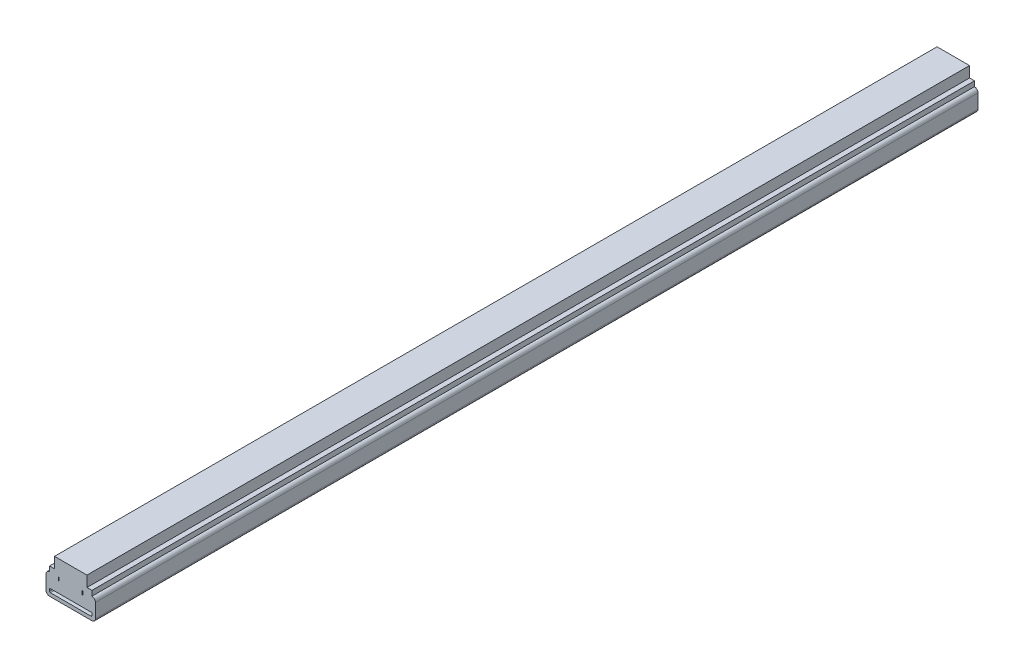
ISO-10303-21;
HEADER;
FILE_DESCRIPTION(('STEP AP214'),'2;1');
FILE_NAME('part.step','',(''),(''),'','','');
FILE_SCHEMA(('AUTOMOTIVE_DESIGN { 1 0 10303 214 1 1 1 1 }'));
ENDSEC;
DATA;
#1=APPLICATION_CONTEXT('core data for automotive mechanical design processes');
#2=APPLICATION_PROTOCOL_DEFINITION('international standard','automotive_design',2000,#1);
#3=PRODUCT_CONTEXT('',#1,'mechanical');
#4=PRODUCT('Part','Part','',(#3));
#5=PRODUCT_RELATED_PRODUCT_CATEGORY('part','',(#4));
#6=PRODUCT_DEFINITION_FORMATION('','',#4);
#7=PRODUCT_DEFINITION_CONTEXT('part definition',#1,'design');
#8=PRODUCT_DEFINITION('design','',#6,#7);
#9=PRODUCT_DEFINITION_SHAPE('','',#8);
#10=(LENGTH_UNIT() NAMED_UNIT(*) SI_UNIT(.MILLI.,.METRE.));
#11=(NAMED_UNIT(*) PLANE_ANGLE_UNIT() SI_UNIT($,.RADIAN.));
#12=(NAMED_UNIT(*) SI_UNIT($,.STERADIAN.) SOLID_ANGLE_UNIT());
#13=UNCERTAINTY_MEASURE_WITH_UNIT(LENGTH_MEASURE(1.E-05),#10,'distance_accuracy_value','');
#14=(GEOMETRIC_REPRESENTATION_CONTEXT(3) GLOBAL_UNCERTAINTY_ASSIGNED_CONTEXT((#13)) GLOBAL_UNIT_ASSIGNED_CONTEXT((#10,
#11,#12)) REPRESENTATION_CONTEXT('',''));
#15=CARTESIAN_POINT('',(0.,0.,0.));
#16=DIRECTION('',(0.,0.,1.));
#17=DIRECTION('',(1.,0.,0.));
#18=AXIS2_PLACEMENT_3D('',#15,#16,#17);
#19=CARTESIAN_POINT('',(9.2000000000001,21.,0.));
#20=DIRECTION('',(0.,1.,0.));
#21=DIRECTION('',(0.,0.,1.));
#22=AXIS2_PLACEMENT_3D('',#19,#20,#21);
#23=PLANE('',#22);
#24=DIRECTION('',(-1.,0.,0.));
#25=VECTOR('',#24,1.);
#26=CARTESIAN_POINT('',(9.2000000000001,21.,500.));
#27=LINE('',#26,#25);
#28=CARTESIAN_POINT('',(9.2000000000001,21.,500.));
#29=VERTEX_POINT('',#28);
#30=CARTESIAN_POINT('',(-9.2,21.,500.));
#31=VERTEX_POINT('',#30);
#32=EDGE_CURVE('E306',#29,#31,#27,.T.);
#33=ORIENTED_EDGE('',*,*,#32,.F.);
#34=DIRECTION('',(0.,0.,1.));
#35=VECTOR('',#34,1.);
#36=CARTESIAN_POINT('',(9.2000000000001,21.,0.));
#37=LINE('',#36,#35);
#38=CARTESIAN_POINT('',(9.2000000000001,21.,0.));
#39=VERTEX_POINT('',#38);
#40=EDGE_CURVE('E9',#39,#29,#37,.T.);
#41=ORIENTED_EDGE('',*,*,#40,.F.);
#42=DIRECTION('',(-1.,0.,0.));
#43=VECTOR('',#42,1.);
#44=CARTESIAN_POINT('',(9.2000000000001,21.,0.));
#45=LINE('',#44,#43);
#46=CARTESIAN_POINT('',(-9.2,21.,0.));
#47=VERTEX_POINT('',#46);
#48=EDGE_CURVE('E313',#39,#47,#45,.T.);
#49=ORIENTED_EDGE('',*,*,#48,.T.);
#50=DIRECTION('',(0.,0.,1.));
#51=VECTOR('',#50,1.);
#52=CARTESIAN_POINT('',(-9.2,21.,0.));
#53=LINE('',#52,#51);
#54=EDGE_CURVE('E17',#47,#31,#53,.T.);
#55=ORIENTED_EDGE('',*,*,#54,.T.);
#56=EDGE_LOOP('',(#33,#41,#49,#55));
#57=FACE_BOUND('',#56,.T.);
#58=ADVANCED_FACE('F14',(#57),#23,.T.);
#59=CARTESIAN_POINT('',(9.2000000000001,21.,0.));
#60=DIRECTION('',(-1.,0.,0.));
#61=DIRECTION('',(0.,-1.,0.));
#62=AXIS2_PLACEMENT_3D('',#59,#60,#61);
#63=PLANE('',#62);
#64=DIRECTION('',(0.,-1.,0.));
#65=VECTOR('',#64,1.);
#66=CARTESIAN_POINT('',(9.2000000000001,21.,500.));
#67=LINE('',#66,#65);
#68=CARTESIAN_POINT('',(9.20000000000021,14.9,500.));
#69=VERTEX_POINT('',#68);
#70=EDGE_CURVE('E317',#29,#69,#67,.T.);
#71=ORIENTED_EDGE('',*,*,#70,.T.);
#72=DIRECTION('',(0.,0.,1.));
#73=VECTOR('',#72,1.);
#74=CARTESIAN_POINT('',(9.20000000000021,14.9,0.));
#75=LINE('',#74,#73);
#76=CARTESIAN_POINT('',(9.20000000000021,14.9,0.));
#77=VERTEX_POINT('',#76);
#78=EDGE_CURVE('E22',#77,#69,#75,.T.);
#79=ORIENTED_EDGE('',*,*,#78,.F.);
#80=DIRECTION('',(0.,-1.,0.));
#81=VECTOR('',#80,1.);
#82=CARTESIAN_POINT('',(9.2000000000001,21.,0.));
#83=LINE('',#82,#81);
#84=EDGE_CURVE('E349',#39,#77,#83,.T.);
#85=ORIENTED_EDGE('',*,*,#84,.F.);
#86=ORIENTED_EDGE('',*,*,#40,.T.);
#87=EDGE_LOOP('',(#71,#79,#85,#86));
#88=FACE_BOUND('',#87,.T.);
#89=ADVANCED_FACE('F427',(#88),#63,.F.);
#90=CARTESIAN_POINT('',(9.20000000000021,14.9,0.));
#91=DIRECTION('',(0.,-1.,0.));
#92=DIRECTION('',(0.,0.,-1.));
#93=AXIS2_PLACEMENT_3D('',#90,#91,#92);
#94=PLANE('',#93);
#95=DIRECTION('',(1.,0.,0.));
#96=VECTOR('',#95,1.);
#97=CARTESIAN_POINT('',(9.20000000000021,14.9,500.));
#98=LINE('',#97,#96);
#99=CARTESIAN_POINT('',(12.0000057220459,14.9,500.));
#100=VERTEX_POINT('',#99);
#101=EDGE_CURVE('E386',#69,#100,#98,.T.);
#102=ORIENTED_EDGE('',*,*,#101,.T.);
#103=DIRECTION('',(0.,0.,1.));
#104=VECTOR('',#103,1.);
#105=CARTESIAN_POINT('',(12.0000057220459,14.9,0.));
#106=LINE('',#105,#104);
#107=CARTESIAN_POINT('',(12.0000057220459,14.9,0.));
#108=VERTEX_POINT('',#107);
#109=EDGE_CURVE('E391',#108,#100,#106,.T.);
#110=ORIENTED_EDGE('',*,*,#109,.F.);
#111=DIRECTION('',(1.,0.,0.));
#112=VECTOR('',#111,1.);
#113=CARTESIAN_POINT('',(9.20000000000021,14.9,0.));
#114=LINE('',#113,#112);
#115=EDGE_CURVE('E347',#77,#108,#114,.T.);
#116=ORIENTED_EDGE('',*,*,#115,.F.);
#117=ORIENTED_EDGE('',*,*,#78,.T.);
#118=EDGE_LOOP('',(#102,#110,#116,#117));
#119=FACE_BOUND('',#118,.T.);
#120=ADVANCED_FACE('F431',(#119),#94,.F.);
#121=CARTESIAN_POINT('',(12.0000057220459,14.9,0.));
#122=DIRECTION('',(-0.999999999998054,1.97311925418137E-06,0.));
#123=DIRECTION('',(-1.97311925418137E-06,-0.999999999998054,0.));
#124=AXIS2_PLACEMENT_3D('',#121,#122,#123);
#125=PLANE('',#124);
#126=DIRECTION('',(-1.97311925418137E-06,-0.999999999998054,0.));
#127=VECTOR('',#126,1.);
#128=CARTESIAN_POINT('',(12.0000057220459,14.9,500.));
#129=LINE('',#128,#127);
#130=CARTESIAN_POINT('',(12.,11.9999999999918,500.));
#131=VERTEX_POINT('',#130);
#132=EDGE_CURVE('E383',#100,#131,#129,.T.);
#133=ORIENTED_EDGE('',*,*,#132,.T.);
#134=DIRECTION('',(0.,0.,1.));
#135=VECTOR('',#134,1.);
#136=CARTESIAN_POINT('',(12.,11.9999999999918,0.));
#137=LINE('',#136,#135);
#138=CARTESIAN_POINT('',(12.,11.9999999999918,0.));
#139=VERTEX_POINT('',#138);
#140=EDGE_CURVE('E394',#139,#131,#137,.T.);
#141=ORIENTED_EDGE('',*,*,#140,.F.);
#142=DIRECTION('',(-1.97311925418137E-06,-0.999999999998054,0.));
#143=VECTOR('',#142,1.);
#144=CARTESIAN_POINT('',(12.0000057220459,14.9,0.));
#145=LINE('',#144,#143);
#146=EDGE_CURVE('E345',#108,#139,#145,.T.);
#147=ORIENTED_EDGE('',*,*,#146,.F.);
#148=ORIENTED_EDGE('',*,*,#109,.T.);
#149=EDGE_LOOP('',(#133,#141,#147,#148));
#150=FACE_BOUND('',#149,.T.);
#151=ADVANCED_FACE('F473',(#150),#125,.F.);
#152=CARTESIAN_POINT('',(12.000005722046,10.,0.));
#153=DIRECTION('',(0.,0.,1.));
#154=DIRECTION('',(1.,0.,0.));
#155=AXIS2_PLACEMENT_3D('',#152,#153,#154);
#156=CYLINDRICAL_SURFACE('',#155,2.);
#157=CARTESIAN_POINT('',(12.000005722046,10.,500.));
#158=DIRECTION('',(0.,0.,1.));
#159=DIRECTION('',(1.,0.,0.));
#160=AXIS2_PLACEMENT_3D('',#157,#158,#159);
#161=CIRCLE('',#160,2.);
#162=CARTESIAN_POINT('',(14.000005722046,10.,500.));
#163=VERTEX_POINT('',#162);
#164=EDGE_CURVE('E380',#163,#131,#161,.T.);
#165=ORIENTED_EDGE('',*,*,#164,.F.);
#166=DIRECTION('',(0.,0.,1.));
#167=VECTOR('',#166,1.);
#168=CARTESIAN_POINT('',(14.000005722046,10.,0.));
#169=LINE('',#168,#167);
#170=CARTESIAN_POINT('',(14.000005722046,10.,0.));
#171=VERTEX_POINT('',#170);
#172=EDGE_CURVE('E396',#171,#163,#169,.T.);
#173=ORIENTED_EDGE('',*,*,#172,.F.);
#174=CARTESIAN_POINT('',(12.000005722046,10.,0.));
#175=DIRECTION('',(0.,0.,1.));
#176=DIRECTION('',(1.,0.,0.));
#177=AXIS2_PLACEMENT_3D('',#174,#175,#176);
#178=CIRCLE('',#177,2.);
#179=EDGE_CURVE('E342',#171,#139,#178,.T.);
#180=ORIENTED_EDGE('',*,*,#179,.T.);
#181=ORIENTED_EDGE('',*,*,#140,.T.);
#182=EDGE_LOOP('',(#165,#173,#180,#181));
#183=FACE_BOUND('',#182,.T.);
#184=ADVANCED_FACE('F470',(#183),#156,.T.);
#185=CARTESIAN_POINT('',(14.000005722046,10.,0.));
#186=DIRECTION('',(-1.,0.,0.));
#187=DIRECTION('',(0.,0.,1.));
#188=AXIS2_PLACEMENT_3D('',#185,#186,#187);
#189=PLANE('',#188);
#190=DIRECTION('',(0.,-1.,0.));
#191=VECTOR('',#190,1.);
#192=CARTESIAN_POINT('',(14.000005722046,10.,500.));
#193=LINE('',#192,#191);
#194=CARTESIAN_POINT('',(14.000005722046,2.,500.));
#195=VERTEX_POINT('',#194);
#196=EDGE_CURVE('E377',#163,#195,#193,.T.);
#197=ORIENTED_EDGE('',*,*,#196,.T.);
#198=DIRECTION('',(0.,0.,1.));
#199=VECTOR('',#198,1.);
#200=CARTESIAN_POINT('',(14.000005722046,2.,0.));
#201=LINE('',#200,#199);
#202=CARTESIAN_POINT('',(14.000005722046,2.,0.));
#203=VERTEX_POINT('',#202);
#204=EDGE_CURVE('E398',#203,#195,#201,.T.);
#205=ORIENTED_EDGE('',*,*,#204,.F.);
#206=DIRECTION('',(0.,-1.,0.));
#207=VECTOR('',#206,1.);
#208=CARTESIAN_POINT('',(14.000005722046,10.,0.));
#209=LINE('',#208,#207);
#210=EDGE_CURVE('E340',#171,#203,#209,.T.);
#211=ORIENTED_EDGE('',*,*,#210,.F.);
#212=ORIENTED_EDGE('',*,*,#172,.T.);
#213=EDGE_LOOP('',(#197,#205,#211,#212));
#214=FACE_BOUND('',#213,.T.);
#215=ADVANCED_FACE('F482',(#214),#189,.F.);
#216=CARTESIAN_POINT('',(12.000005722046,2.,0.));
#217=DIRECTION('',(0.,0.,1.));
#218=DIRECTION('',(1.,0.,0.));
#219=AXIS2_PLACEMENT_3D('',#216,#217,#218);
#220=CYLINDRICAL_SURFACE('',#219,2.);
#221=CARTESIAN_POINT('',(12.000005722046,2.,500.));
#222=DIRECTION('',(0.,0.,1.));
#223=DIRECTION('',(1.,0.,0.));
#224=AXIS2_PLACEMENT_3D('',#221,#222,#223);
#225=CIRCLE('',#224,2.);
#226=CARTESIAN_POINT('',(12.000005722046,0.,500.));
#227=VERTEX_POINT('',#226);
#228=EDGE_CURVE('E374',#227,#195,#225,.T.);
#229=ORIENTED_EDGE('',*,*,#228,.F.);
#230=DIRECTION('',(0.,0.,1.));
#231=VECTOR('',#230,1.);
#232=CARTESIAN_POINT('',(12.000005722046,0.,0.));
#233=LINE('',#232,#231);
#234=CARTESIAN_POINT('',(12.000005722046,0.,0.));
#235=VERTEX_POINT('',#234);
#236=EDGE_CURVE('E400',#235,#227,#233,.T.);
#237=ORIENTED_EDGE('',*,*,#236,.F.);
#238=CARTESIAN_POINT('',(12.000005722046,2.,0.));
#239=DIRECTION('',(0.,0.,1.));
#240=DIRECTION('',(1.,0.,0.));
#241=AXIS2_PLACEMENT_3D('',#238,#239,#240);
#242=CIRCLE('',#241,2.);
#243=EDGE_CURVE('E337',#235,#203,#242,.T.);
#244=ORIENTED_EDGE('',*,*,#243,.T.);
#245=ORIENTED_EDGE('',*,*,#204,.T.);
#246=EDGE_LOOP('',(#229,#237,#244,#245));
#247=FACE_BOUND('',#246,.T.);
#248=ADVANCED_FACE('F464',(#247),#220,.T.);
#249=CARTESIAN_POINT('',(12.000005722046,0.,0.));
#250=DIRECTION('',(0.,1.,0.));
#251=DIRECTION('',(-1.,0.,0.));
#252=AXIS2_PLACEMENT_3D('',#249,#250,#251);
#253=PLANE('',#252);
#254=DIRECTION('',(-1.,0.,0.));
#255=VECTOR('',#254,1.);
#256=CARTESIAN_POINT('',(12.000005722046,0.,500.));
#257=LINE('',#256,#255);
#258=CARTESIAN_POINT('',(-12.000005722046,0.,500.));
#259=VERTEX_POINT('',#258);
#260=EDGE_CURVE('E371',#227,#259,#257,.T.);
#261=ORIENTED_EDGE('',*,*,#260,.T.);
#262=DIRECTION('',(0.,0.,1.));
#263=VECTOR('',#262,1.);
#264=CARTESIAN_POINT('',(-12.000005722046,0.,0.));
#265=LINE('',#264,#263);
#266=CARTESIAN_POINT('',(-12.000005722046,0.,0.));
#267=VERTEX_POINT('',#266);
#268=EDGE_CURVE('E402',#267,#259,#265,.T.);
#269=ORIENTED_EDGE('',*,*,#268,.F.);
#270=DIRECTION('',(-1.,0.,0.));
#271=VECTOR('',#270,1.);
#272=CARTESIAN_POINT('',(12.000005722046,0.,0.));
#273=LINE('',#272,#271);
#274=EDGE_CURVE('E335',#235,#267,#273,.T.);
#275=ORIENTED_EDGE('',*,*,#274,.F.);
#276=ORIENTED_EDGE('',*,*,#236,.T.);
#277=EDGE_LOOP('',(#261,#269,#275,#276));
#278=FACE_BOUND('',#277,.T.);
#279=ADVANCED_FACE('F461',(#278),#253,.F.);
#280=CARTESIAN_POINT('',(-12.000005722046,2.,0.));
#281=DIRECTION('',(0.,0.,1.));
#282=DIRECTION('',(1.,0.,0.));
#283=AXIS2_PLACEMENT_3D('',#280,#281,#282);
#284=CYLINDRICAL_SURFACE('',#283,2.);
#285=CARTESIAN_POINT('',(-12.000005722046,2.,500.));
#286=DIRECTION('',(0.,0.,1.));
#287=DIRECTION('',(1.,0.,0.));
#288=AXIS2_PLACEMENT_3D('',#285,#286,#287);
#289=CIRCLE('',#288,2.);
#290=CARTESIAN_POINT('',(-14.000005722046,2.,500.));
#291=VERTEX_POINT('',#290);
#292=EDGE_CURVE('E368',#291,#259,#289,.T.);
#293=ORIENTED_EDGE('',*,*,#292,.F.);
#294=DIRECTION('',(0.,0.,1.));
#295=VECTOR('',#294,1.);
#296=CARTESIAN_POINT('',(-14.000005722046,2.,0.));
#297=LINE('',#296,#295);
#298=CARTESIAN_POINT('',(-14.000005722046,2.,0.));
#299=VERTEX_POINT('',#298);
#300=EDGE_CURVE('E404',#299,#291,#297,.T.);
#301=ORIENTED_EDGE('',*,*,#300,.F.);
#302=CARTESIAN_POINT('',(-12.000005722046,2.,0.));
#303=DIRECTION('',(0.,0.,1.));
#304=DIRECTION('',(1.,0.,0.));
#305=AXIS2_PLACEMENT_3D('',#302,#303,#304);
#306=CIRCLE('',#305,2.);
#307=EDGE_CURVE('E332',#299,#267,#306,.T.);
#308=ORIENTED_EDGE('',*,*,#307,.T.);
#309=ORIENTED_EDGE('',*,*,#268,.T.);
#310=EDGE_LOOP('',(#293,#301,#308,#309));
#311=FACE_BOUND('',#310,.T.);
#312=ADVANCED_FACE('F456',(#311),#284,.T.);
#313=CARTESIAN_POINT('',(-14.0000057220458,10.,0.));
#314=DIRECTION('',(-1.,0.,0.));
#315=DIRECTION('',(0.,-1.,0.));
#316=AXIS2_PLACEMENT_3D('',#313,#314,#315);
#317=PLANE('',#316);
#318=DIRECTION('',(0.,-1.,0.));
#319=VECTOR('',#318,1.);
#320=CARTESIAN_POINT('',(-14.0000057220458,10.,500.));
#321=LINE('',#320,#319);
#322=CARTESIAN_POINT('',(-14.0000057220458,10.,500.));
#323=VERTEX_POINT('',#322);
#324=EDGE_CURVE('E365',#323,#291,#321,.T.);
#325=ORIENTED_EDGE('',*,*,#324,.F.);
#326=DIRECTION('',(0.,0.,1.));
#327=VECTOR('',#326,1.);
#328=CARTESIAN_POINT('',(-14.0000057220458,10.,0.));
#329=LINE('',#328,#327);
#330=CARTESIAN_POINT('',(-14.0000057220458,10.,0.));
#331=VERTEX_POINT('',#330);
#332=EDGE_CURVE('E406',#331,#323,#329,.T.);
#333=ORIENTED_EDGE('',*,*,#332,.F.);
#334=DIRECTION('',(0.,-1.,0.));
#335=VECTOR('',#334,1.);
#336=CARTESIAN_POINT('',(-14.0000057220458,10.,0.));
#337=LINE('',#336,#335);
#338=EDGE_CURVE('E329',#331,#299,#337,.T.);
#339=ORIENTED_EDGE('',*,*,#338,.T.);
#340=ORIENTED_EDGE('',*,*,#300,.T.);
#341=EDGE_LOOP('',(#325,#333,#339,#340));
#342=FACE_BOUND('',#341,.T.);
#343=ADVANCED_FACE('F451',(#342),#317,.T.);
#344=CARTESIAN_POINT('',(-12.0000057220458,10.,0.));
#345=DIRECTION('',(0.,0.,1.));
#346=DIRECTION('',(1.,0.,0.));
#347=AXIS2_PLACEMENT_3D('',#344,#345,#346);
#348=CYLINDRICAL_SURFACE('',#347,2.);
#349=CARTESIAN_POINT('',(-12.0000057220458,10.,500.));
#350=DIRECTION('',(0.,0.,1.));
#351=DIRECTION('',(1.,0.,0.));
#352=AXIS2_PLACEMENT_3D('',#349,#350,#351);
#353=CIRCLE('',#352,2.);
#354=CARTESIAN_POINT('',(-12.0000057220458,12.,500.));
#355=VERTEX_POINT('',#354);
#356=EDGE_CURVE('E362',#355,#323,#353,.T.);
#357=ORIENTED_EDGE('',*,*,#356,.F.);
#358=DIRECTION('',(0.,0.,1.));
#359=VECTOR('',#358,1.);
#360=CARTESIAN_POINT('',(-12.0000057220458,12.,0.));
#361=LINE('',#360,#359);
#362=CARTESIAN_POINT('',(-12.0000057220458,12.,0.));
#363=VERTEX_POINT('',#362);
#364=EDGE_CURVE('E408',#363,#355,#361,.T.);
#365=ORIENTED_EDGE('',*,*,#364,.F.);
#366=CARTESIAN_POINT('',(-12.0000057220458,10.,0.));
#367=DIRECTION('',(0.,0.,1.));
#368=DIRECTION('',(1.,0.,0.));
#369=AXIS2_PLACEMENT_3D('',#366,#367,#368);
#370=CIRCLE('',#369,2.);
#371=EDGE_CURVE('E326',#363,#331,#370,.T.);
#372=ORIENTED_EDGE('',*,*,#371,.T.);
#373=ORIENTED_EDGE('',*,*,#332,.T.);
#374=EDGE_LOOP('',(#357,#365,#372,#373));
#375=FACE_BOUND('',#374,.T.);
#376=ADVANCED_FACE('F447',(#375),#348,.T.);
#377=CARTESIAN_POINT('',(-12.,14.9,0.));
#378=DIRECTION('',(-0.999999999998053,1.97311927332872E-06,0.));
#379=DIRECTION('',(-1.97311927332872E-06,-0.999999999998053,0.));
#380=AXIS2_PLACEMENT_3D('',#377,#378,#379);
#381=PLANE('',#380);
#382=DIRECTION('',(-1.97311927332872E-06,-0.999999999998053,0.));
#383=VECTOR('',#382,1.);
#384=CARTESIAN_POINT('',(-12.,14.9,500.));
#385=LINE('',#384,#383);
#386=CARTESIAN_POINT('',(-12.,14.9,500.));
#387=VERTEX_POINT('',#386);
#388=EDGE_CURVE('E359',#387,#355,#385,.T.);
#389=ORIENTED_EDGE('',*,*,#388,.F.);
#390=DIRECTION('',(0.,0.,1.));
#391=VECTOR('',#390,1.);
#392=CARTESIAN_POINT('',(-12.,14.9,0.));
#393=LINE('',#392,#391);
#394=CARTESIAN_POINT('',(-12.,14.9,0.));
#395=VERTEX_POINT('',#394);
#396=EDGE_CURVE('E410',#395,#387,#393,.T.);
#397=ORIENTED_EDGE('',*,*,#396,.F.);
#398=DIRECTION('',(-1.97311927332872E-06,-0.999999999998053,0.));
#399=VECTOR('',#398,1.);
#400=CARTESIAN_POINT('',(-12.,14.9,0.));
#401=LINE('',#400,#399);
#402=EDGE_CURVE('E323',#395,#363,#401,.T.);
#403=ORIENTED_EDGE('',*,*,#402,.T.);
#404=ORIENTED_EDGE('',*,*,#364,.T.);
#405=EDGE_LOOP('',(#389,#397,#403,#404));
#406=FACE_BOUND('',#405,.T.);
#407=ADVANCED_FACE('F445',(#406),#381,.T.);
#408=CARTESIAN_POINT('',(-9.2,14.9,0.));
#409=DIRECTION('',(0.,1.,0.));
#410=DIRECTION('',(0.,0.,1.));
#411=AXIS2_PLACEMENT_3D('',#408,#409,#410);
#412=PLANE('',#411);
#413=DIRECTION('',(-1.,0.,0.));
#414=VECTOR('',#413,1.);
#415=CARTESIAN_POINT('',(-9.2,14.9,500.));
#416=LINE('',#415,#414);
#417=CARTESIAN_POINT('',(-9.2,14.9,500.));
#418=VERTEX_POINT('',#417);
#419=EDGE_CURVE('E356',#418,#387,#416,.T.);
#420=ORIENTED_EDGE('',*,*,#419,.F.);
#421=DIRECTION('',(0.,0.,1.));
#422=VECTOR('',#421,1.);
#423=CARTESIAN_POINT('',(-9.2,14.9,0.));
#424=LINE('',#423,#422);
#425=CARTESIAN_POINT('',(-9.2,14.9,0.));
#426=VERTEX_POINT('',#425);
#427=EDGE_CURVE('E411',#426,#418,#424,.T.);
#428=ORIENTED_EDGE('',*,*,#427,.F.);
#429=DIRECTION('',(-1.,0.,0.));
#430=VECTOR('',#429,1.);
#431=CARTESIAN_POINT('',(-9.2,14.9,0.));
#432=LINE('',#431,#430);
#433=EDGE_CURVE('E320',#426,#395,#432,.T.);
#434=ORIENTED_EDGE('',*,*,#433,.T.);
#435=ORIENTED_EDGE('',*,*,#396,.T.);
#436=EDGE_LOOP('',(#420,#428,#434,#435));
#437=FACE_BOUND('',#436,.T.);
#438=ADVANCED_FACE('F441',(#437),#412,.T.);
#439=CARTESIAN_POINT('',(-9.2,21.,0.));
#440=DIRECTION('',(-1.,0.,0.));
#441=DIRECTION('',(0.,0.,1.));
#442=AXIS2_PLACEMENT_3D('',#439,#440,#441);
#443=PLANE('',#442);
#444=DIRECTION('',(0.,-1.,0.));
#445=VECTOR('',#444,1.);
#446=CARTESIAN_POINT('',(-9.2,21.,500.));
#447=LINE('',#446,#445);
#448=EDGE_CURVE('E353',#31,#418,#447,.T.);
#449=ORIENTED_EDGE('',*,*,#448,.F.);
#450=ORIENTED_EDGE('',*,*,#54,.F.);
#451=DIRECTION('',(0.,-1.,0.));
#452=VECTOR('',#451,1.);
#453=CARTESIAN_POINT('',(-9.2,21.,0.));
#454=LINE('',#453,#452);
#455=EDGE_CURVE('E316',#47,#426,#454,.T.);
#456=ORIENTED_EDGE('',*,*,#455,.T.);
#457=ORIENTED_EDGE('',*,*,#427,.T.);
#458=EDGE_LOOP('',(#449,#450,#456,#457));
#459=FACE_BOUND('',#458,.T.);
#460=ADVANCED_FACE('F419',(#459),#443,.T.);
#461=CARTESIAN_POINT('',(-12.0000057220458,10.,0.));
#462=DIRECTION('',(0.,0.,1.));
#463=DIRECTION('',(1.,0.,0.));
#464=AXIS2_PLACEMENT_3D('',#461,#462,#463);
#465=PLANE('',#464);
#466=DIRECTION('',(-1.,0.,0.));
#467=VECTOR('',#466,1.);
#468=CARTESIAN_POINT('',(11.5,2.,0.));
#469=LINE('',#468,#467);
#470=CARTESIAN_POINT('',(11.5,2.,0.));
#471=VERTEX_POINT('',#470);
#472=CARTESIAN_POINT('',(-11.5,2.,0.));
#473=VERTEX_POINT('',#472);
#474=EDGE_CURVE('E212',#471,#473,#469,.T.);
#475=ORIENTED_EDGE('',*,*,#474,.F.);
#476=CARTESIAN_POINT('',(11.5,2.5,0.));
#477=DIRECTION('',(0.,0.,1.));
#478=DIRECTION('',(1.,0.,0.));
#479=AXIS2_PLACEMENT_3D('',#476,#477,#478);
#480=CIRCLE('',#479,0.5);
#481=CARTESIAN_POINT('',(12.,2.5,0.));
#482=VERTEX_POINT('',#481);
#483=EDGE_CURVE('E207',#471,#482,#480,.T.);
#484=ORIENTED_EDGE('',*,*,#483,.T.);
#485=DIRECTION('',(0.,-1.,0.));
#486=VECTOR('',#485,1.);
#487=CARTESIAN_POINT('',(12.,4.00000000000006,0.));
#488=LINE('',#487,#486);
#489=CARTESIAN_POINT('',(12.,4.00000000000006,0.));
#490=VERTEX_POINT('',#489);
#491=EDGE_CURVE('E199',#490,#482,#488,.T.);
#492=ORIENTED_EDGE('',*,*,#491,.F.);
#493=DIRECTION('',(-1.,0.,0.));
#494=VECTOR('',#493,1.);
#495=CARTESIAN_POINT('',(12.,4.00000000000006,0.));
#496=LINE('',#495,#494);
#497=CARTESIAN_POINT('',(-12.,4.00000000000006,0.));
#498=VERTEX_POINT('',#497);
#499=EDGE_CURVE('E30',#490,#498,#496,.T.);
#500=ORIENTED_EDGE('',*,*,#499,.T.);
#501=DIRECTION('',(0.,-1.,0.));
#502=VECTOR('',#501,1.);
#503=CARTESIAN_POINT('',(-12.,4.00000000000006,0.));
#504=LINE('',#503,#502);
#505=CARTESIAN_POINT('',(-12.,2.5,0.));
#506=VERTEX_POINT('',#505);
#507=EDGE_CURVE('E224',#498,#506,#504,.T.);
#508=ORIENTED_EDGE('',*,*,#507,.T.);
#509=CARTESIAN_POINT('',(-11.5,2.5,0.));
#510=DIRECTION('',(0.,0.,1.));
#511=DIRECTION('',(1.,0.,0.));
#512=AXIS2_PLACEMENT_3D('',#509,#510,#511);
#513=CIRCLE('',#512,0.5);
#514=EDGE_CURVE('E227',#506,#473,#513,.T.);
#515=ORIENTED_EDGE('',*,*,#514,.T.);
#516=EDGE_LOOP('',(#475,#484,#492,#500,#508,#515));
#517=FACE_BOUND('',#516,.T.);
#518=DIRECTION('',(0.,-1.,0.));
#519=VECTOR('',#518,1.);
#520=CARTESIAN_POINT('',(7.,12.,0.));
#521=LINE('',#520,#519);
#522=CARTESIAN_POINT('',(7.,12.,0.));
#523=VERTEX_POINT('',#522);
#524=CARTESIAN_POINT('',(7.,10.,0.));
#525=VERTEX_POINT('',#524);
#526=EDGE_CURVE('E261',#523,#525,#521,.T.);
#527=ORIENTED_EDGE('',*,*,#526,.F.);
#528=DIRECTION('',(-1.,0.,0.));
#529=VECTOR('',#528,1.);
#530=CARTESIAN_POINT('',(7.,12.,0.));
#531=LINE('',#530,#529);
#532=CARTESIAN_POINT('',(6.5,12.,0.));
#533=VERTEX_POINT('',#532);
#534=EDGE_CURVE('E251',#523,#533,#531,.T.);
#535=ORIENTED_EDGE('',*,*,#534,.T.);
#536=DIRECTION('',(0.,-1.,0.));
#537=VECTOR('',#536,1.);
#538=CARTESIAN_POINT('',(6.5,12.,0.));
#539=LINE('',#538,#537);
#540=CARTESIAN_POINT('',(6.5,10.,0.));
#541=VERTEX_POINT('',#540);
#542=EDGE_CURVE('E254',#533,#541,#539,.T.);
#543=ORIENTED_EDGE('',*,*,#542,.T.);
#544=DIRECTION('',(1.,0.,0.));
#545=VECTOR('',#544,1.);
#546=CARTESIAN_POINT('',(6.5,10.,0.));
#547=LINE('',#546,#545);
#548=EDGE_CURVE('E258',#541,#525,#547,.T.);
#549=ORIENTED_EDGE('',*,*,#548,.T.);
#550=EDGE_LOOP('',(#527,#535,#543,#549));
#551=FACE_BOUND('',#550,.T.);
#552=DIRECTION('',(0.,-1.,0.));
#553=VECTOR('',#552,1.);
#554=CARTESIAN_POINT('',(-6.5,12.,0.));
#555=LINE('',#554,#553);
#556=CARTESIAN_POINT('',(-6.5,12.,0.));
#557=VERTEX_POINT('',#556);
#558=CARTESIAN_POINT('',(-6.5,10.,0.));
#559=VERTEX_POINT('',#558);
#560=EDGE_CURVE('E292',#557,#559,#555,.T.);
#561=ORIENTED_EDGE('',*,*,#560,.F.);
#562=DIRECTION('',(-1.,0.,0.));
#563=VECTOR('',#562,1.);
#564=CARTESIAN_POINT('',(-6.5,12.,0.));
#565=LINE('',#564,#563);
#566=CARTESIAN_POINT('',(-7.,12.,0.));
#567=VERTEX_POINT('',#566);
#568=EDGE_CURVE('E282',#557,#567,#565,.T.);
#569=ORIENTED_EDGE('',*,*,#568,.T.);
#570=DIRECTION('',(0.,-1.,0.));
#571=VECTOR('',#570,1.);
#572=CARTESIAN_POINT('',(-7.,12.,0.));
#573=LINE('',#572,#571);
#574=CARTESIAN_POINT('',(-7.,10.,0.));
#575=VERTEX_POINT('',#574);
#576=EDGE_CURVE('E285',#567,#575,#573,.T.);
#577=ORIENTED_EDGE('',*,*,#576,.T.);
#578=DIRECTION('',(-1.,0.,0.));
#579=VECTOR('',#578,1.);
#580=CARTESIAN_POINT('',(-6.5,10.,0.));
#581=LINE('',#580,#579);
#582=EDGE_CURVE('E289',#559,#575,#581,.T.);
#583=ORIENTED_EDGE('',*,*,#582,.F.);
#584=EDGE_LOOP('',(#561,#569,#577,#583));
#585=FACE_BOUND('',#584,.T.);
#586=ORIENTED_EDGE('',*,*,#48,.F.);
#587=ORIENTED_EDGE('',*,*,#84,.T.);
#588=ORIENTED_EDGE('',*,*,#115,.T.);
#589=ORIENTED_EDGE('',*,*,#146,.T.);
#590=ORIENTED_EDGE('',*,*,#179,.F.);
#591=ORIENTED_EDGE('',*,*,#210,.T.);
#592=ORIENTED_EDGE('',*,*,#243,.F.);
#593=ORIENTED_EDGE('',*,*,#274,.T.);
#594=ORIENTED_EDGE('',*,*,#307,.F.);
#595=ORIENTED_EDGE('',*,*,#338,.F.);
#596=ORIENTED_EDGE('',*,*,#371,.F.);
#597=ORIENTED_EDGE('',*,*,#402,.F.);
#598=ORIENTED_EDGE('',*,*,#433,.F.);
#599=ORIENTED_EDGE('',*,*,#455,.F.);
#600=EDGE_LOOP('',(#586,#587,#588,#589,#590,#591,#592,#593,#594,#595,#596,#597,#598,#599));
#601=FACE_BOUND('',#600,.T.);
#602=ADVANCED_FACE('F214',(#517,#551,#585,#601),#465,.F.);
#603=CARTESIAN_POINT('',(-12.0000057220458,10.,500.));
#604=DIRECTION('',(0.,0.,1.));
#605=DIRECTION('',(1.,0.,0.));
#606=AXIS2_PLACEMENT_3D('',#603,#604,#605);
#607=PLANE('',#606);
#608=CARTESIAN_POINT('',(11.5,2.5,500.));
#609=DIRECTION('',(0.,0.,1.));
#610=DIRECTION('',(1.,0.,0.));
#611=AXIS2_PLACEMENT_3D('',#608,#609,#610);
#612=CIRCLE('',#611,0.5);
#613=CARTESIAN_POINT('',(11.5,2.,500.));
#614=VERTEX_POINT('',#613);
#615=CARTESIAN_POINT('',(12.,2.5,500.));
#616=VERTEX_POINT('',#615);
#617=EDGE_CURVE('E38',#614,#616,#612,.T.);
#618=ORIENTED_EDGE('',*,*,#617,.F.);
#619=DIRECTION('',(-1.,0.,0.));
#620=VECTOR('',#619,1.);
#621=CARTESIAN_POINT('',(11.5,2.,500.));
#622=LINE('',#621,#620);
#623=CARTESIAN_POINT('',(-11.5,2.,500.));
#624=VERTEX_POINT('',#623);
#625=EDGE_CURVE('E217',#614,#624,#622,.T.);
#626=ORIENTED_EDGE('',*,*,#625,.T.);
#627=CARTESIAN_POINT('',(-11.5,2.5,500.));
#628=DIRECTION('',(0.,0.,1.));
#629=DIRECTION('',(1.,0.,0.));
#630=AXIS2_PLACEMENT_3D('',#627,#628,#629);
#631=CIRCLE('',#630,0.5);
#632=CARTESIAN_POINT('',(-12.,2.5,500.));
#633=VERTEX_POINT('',#632);
#634=EDGE_CURVE('E220',#633,#624,#631,.T.);
#635=ORIENTED_EDGE('',*,*,#634,.F.);
#636=DIRECTION('',(0.,-1.,0.));
#637=VECTOR('',#636,1.);
#638=CARTESIAN_POINT('',(-12.,4.00000000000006,500.));
#639=LINE('',#638,#637);
#640=CARTESIAN_POINT('',(-12.,4.00000000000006,500.));
#641=VERTEX_POINT('',#640);
#642=EDGE_CURVE('E236',#641,#633,#639,.T.);
#643=ORIENTED_EDGE('',*,*,#642,.F.);
#644=DIRECTION('',(-1.,0.,0.));
#645=VECTOR('',#644,1.);
#646=CARTESIAN_POINT('',(12.,4.00000000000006,500.));
#647=LINE('',#646,#645);
#648=CARTESIAN_POINT('',(12.,4.00000000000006,500.));
#649=VERTEX_POINT('',#648);
#650=EDGE_CURVE('E233',#649,#641,#647,.T.);
#651=ORIENTED_EDGE('',*,*,#650,.F.);
#652=DIRECTION('',(0.,-1.,0.));
#653=VECTOR('',#652,1.);
#654=CARTESIAN_POINT('',(12.,4.00000000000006,500.));
#655=LINE('',#654,#653);
#656=EDGE_CURVE('E231',#649,#616,#655,.T.);
#657=ORIENTED_EDGE('',*,*,#656,.T.);
#658=EDGE_LOOP('',(#618,#626,#635,#643,#651,#657));
#659=FACE_BOUND('',#658,.T.);
#660=DIRECTION('',(-1.,0.,0.));
#661=VECTOR('',#660,1.);
#662=CARTESIAN_POINT('',(7.,12.,500.));
#663=LINE('',#662,#661);
#664=CARTESIAN_POINT('',(7.,12.,500.));
#665=VERTEX_POINT('',#664);
#666=CARTESIAN_POINT('',(6.5,12.,500.));
#667=VERTEX_POINT('',#666);
#668=EDGE_CURVE('E243',#665,#667,#663,.T.);
#669=ORIENTED_EDGE('',*,*,#668,.F.);
#670=DIRECTION('',(0.,-1.,0.));
#671=VECTOR('',#670,1.);
#672=CARTESIAN_POINT('',(7.,12.,500.));
#673=LINE('',#672,#671);
#674=CARTESIAN_POINT('',(7.,10.,500.));
#675=VERTEX_POINT('',#674);
#676=EDGE_CURVE('E255',#665,#675,#673,.T.);
#677=ORIENTED_EDGE('',*,*,#676,.T.);
#678=DIRECTION('',(1.,0.,0.));
#679=VECTOR('',#678,1.);
#680=CARTESIAN_POINT('',(6.5,10.,500.));
#681=LINE('',#680,#679);
#682=CARTESIAN_POINT('',(6.5,10.,500.));
#683=VERTEX_POINT('',#682);
#684=EDGE_CURVE('E268',#683,#675,#681,.T.);
#685=ORIENTED_EDGE('',*,*,#684,.F.);
#686=DIRECTION('',(0.,-1.,0.));
#687=VECTOR('',#686,1.);
#688=CARTESIAN_POINT('',(6.5,12.,500.));
#689=LINE('',#688,#687);
#690=EDGE_CURVE('E265',#667,#683,#689,.T.);
#691=ORIENTED_EDGE('',*,*,#690,.F.);
#692=EDGE_LOOP('',(#669,#677,#685,#691));
#693=FACE_BOUND('',#692,.T.);
#694=DIRECTION('',(-1.,0.,0.));
#695=VECTOR('',#694,1.);
#696=CARTESIAN_POINT('',(-6.5,12.,500.));
#697=LINE('',#696,#695);
#698=CARTESIAN_POINT('',(-6.5,12.,500.));
#699=VERTEX_POINT('',#698);
#700=CARTESIAN_POINT('',(-7.,12.,500.));
#701=VERTEX_POINT('',#700);
#702=EDGE_CURVE('E275',#699,#701,#697,.T.);
#703=ORIENTED_EDGE('',*,*,#702,.F.);
#704=DIRECTION('',(0.,-1.,0.));
#705=VECTOR('',#704,1.);
#706=CARTESIAN_POINT('',(-6.5,12.,500.));
#707=LINE('',#706,#705);
#708=CARTESIAN_POINT('',(-6.5,10.,500.));
#709=VERTEX_POINT('',#708);
#710=EDGE_CURVE('E286',#699,#709,#707,.T.);
#711=ORIENTED_EDGE('',*,*,#710,.T.);
#712=DIRECTION('',(-1.,0.,0.));
#713=VECTOR('',#712,1.);
#714=CARTESIAN_POINT('',(-6.5,10.,500.));
#715=LINE('',#714,#713);
#716=CARTESIAN_POINT('',(-7.,10.,500.));
#717=VERTEX_POINT('',#716);
#718=EDGE_CURVE('E299',#709,#717,#715,.T.);
#719=ORIENTED_EDGE('',*,*,#718,.T.);
#720=DIRECTION('',(0.,-1.,0.));
#721=VECTOR('',#720,1.);
#722=CARTESIAN_POINT('',(-7.,12.,500.));
#723=LINE('',#722,#721);
#724=EDGE_CURVE('E296',#701,#717,#723,.T.);
#725=ORIENTED_EDGE('',*,*,#724,.F.);
#726=EDGE_LOOP('',(#703,#711,#719,#725));
#727=FACE_BOUND('',#726,.T.);
#728=ORIENTED_EDGE('',*,*,#32,.T.);
#729=ORIENTED_EDGE('',*,*,#448,.T.);
#730=ORIENTED_EDGE('',*,*,#419,.T.);
#731=ORIENTED_EDGE('',*,*,#388,.T.);
#732=ORIENTED_EDGE('',*,*,#356,.T.);
#733=ORIENTED_EDGE('',*,*,#324,.T.);
#734=ORIENTED_EDGE('',*,*,#292,.T.);
#735=ORIENTED_EDGE('',*,*,#260,.F.);
#736=ORIENTED_EDGE('',*,*,#228,.T.);
#737=ORIENTED_EDGE('',*,*,#196,.F.);
#738=ORIENTED_EDGE('',*,*,#164,.T.);
#739=ORIENTED_EDGE('',*,*,#132,.F.);
#740=ORIENTED_EDGE('',*,*,#101,.F.);
#741=ORIENTED_EDGE('',*,*,#70,.F.);
#742=EDGE_LOOP('',(#728,#729,#730,#731,#732,#733,#734,#735,#736,#737,#738,#739,#740,#741));
#743=FACE_BOUND('',#742,.T.);
#744=ADVANCED_FACE('F422',(#659,#693,#727,#743),#607,.T.);
#745=CARTESIAN_POINT('',(-6.5,12.,0.));
#746=DIRECTION('',(0.,1.,0.));
#747=DIRECTION('',(0.,0.,1.));
#748=AXIS2_PLACEMENT_3D('',#745,#746,#747);
#749=PLANE('',#748);
#750=ORIENTED_EDGE('',*,*,#702,.T.);
#751=DIRECTION('',(0.,0.,1.));
#752=VECTOR('',#751,1.);
#753=CARTESIAN_POINT('',(-7.,12.,0.));
#754=LINE('',#753,#752);
#755=EDGE_CURVE('E294',#567,#701,#754,.T.);
#756=ORIENTED_EDGE('',*,*,#755,.F.);
#757=ORIENTED_EDGE('',*,*,#568,.F.);
#758=DIRECTION('',(0.,0.,1.));
#759=VECTOR('',#758,1.);
#760=CARTESIAN_POINT('',(-6.5,12.,0.));
#761=LINE('',#760,#759);
#762=EDGE_CURVE('E304',#557,#699,#761,.T.);
#763=ORIENTED_EDGE('',*,*,#762,.T.);
#764=EDGE_LOOP('',(#750,#756,#757,#763));
#765=FACE_BOUND('',#764,.T.);
#766=ADVANCED_FACE('F497',(#765),#749,.F.);
#767=CARTESIAN_POINT('',(-6.5,12.,0.));
#768=DIRECTION('',(-1.,0.,0.));
#769=DIRECTION('',(0.,0.,1.));
#770=AXIS2_PLACEMENT_3D('',#767,#768,#769);
#771=PLANE('',#770);
#772=ORIENTED_EDGE('',*,*,#710,.F.);
#773=ORIENTED_EDGE('',*,*,#762,.F.);
#774=ORIENTED_EDGE('',*,*,#560,.T.);
#775=DIRECTION('',(0.,0.,1.));
#776=VECTOR('',#775,1.);
#777=CARTESIAN_POINT('',(-6.5,10.,0.));
#778=LINE('',#777,#776);
#779=EDGE_CURVE('E307',#559,#709,#778,.T.);
#780=ORIENTED_EDGE('',*,*,#779,.T.);
#781=EDGE_LOOP('',(#772,#773,#774,#780));
#782=FACE_BOUND('',#781,.T.);
#783=ADVANCED_FACE('F503',(#782),#771,.T.);
#784=CARTESIAN_POINT('',(-6.5,10.,0.));
#785=DIRECTION('',(0.,1.,0.));
#786=DIRECTION('',(0.,0.,1.));
#787=AXIS2_PLACEMENT_3D('',#784,#785,#786);
#788=PLANE('',#787);
#789=ORIENTED_EDGE('',*,*,#718,.F.);
#790=ORIENTED_EDGE('',*,*,#779,.F.);
#791=ORIENTED_EDGE('',*,*,#582,.T.);
#792=DIRECTION('',(0.,0.,1.));
#793=VECTOR('',#792,1.);
#794=CARTESIAN_POINT('',(-7.,10.,0.));
#795=LINE('',#794,#793);
#796=EDGE_CURVE('E309',#575,#717,#795,.T.);
#797=ORIENTED_EDGE('',*,*,#796,.T.);
#798=EDGE_LOOP('',(#789,#790,#791,#797));
#799=FACE_BOUND('',#798,.T.);
#800=ADVANCED_FACE('F509',(#799),#788,.T.);
#801=CARTESIAN_POINT('',(-7.,12.,0.));
#802=DIRECTION('',(-1.,0.,0.));
#803=DIRECTION('',(0.,0.,1.));
#804=AXIS2_PLACEMENT_3D('',#801,#802,#803);
#805=PLANE('',#804);
#806=ORIENTED_EDGE('',*,*,#724,.T.);
#807=ORIENTED_EDGE('',*,*,#796,.F.);
#808=ORIENTED_EDGE('',*,*,#576,.F.);
#809=ORIENTED_EDGE('',*,*,#755,.T.);
#810=EDGE_LOOP('',(#806,#807,#808,#809));
#811=FACE_BOUND('',#810,.T.);
#812=ADVANCED_FACE('F505',(#811),#805,.F.);
#813=CARTESIAN_POINT('',(7.,12.,0.));
#814=DIRECTION('',(0.,1.,0.));
#815=DIRECTION('',(0.,0.,1.));
#816=AXIS2_PLACEMENT_3D('',#813,#814,#815);
#817=PLANE('',#816);
#818=ORIENTED_EDGE('',*,*,#668,.T.);
#819=DIRECTION('',(0.,0.,1.));
#820=VECTOR('',#819,1.);
#821=CARTESIAN_POINT('',(6.5,12.,0.));
#822=LINE('',#821,#820);
#823=EDGE_CURVE('E263',#533,#667,#822,.T.);
#824=ORIENTED_EDGE('',*,*,#823,.F.);
#825=ORIENTED_EDGE('',*,*,#534,.F.);
#826=DIRECTION('',(0.,0.,1.));
#827=VECTOR('',#826,1.);
#828=CARTESIAN_POINT('',(7.,12.,0.));
#829=LINE('',#828,#827);
#830=EDGE_CURVE('E273',#523,#665,#829,.T.);
#831=ORIENTED_EDGE('',*,*,#830,.T.);
#832=EDGE_LOOP('',(#818,#824,#825,#831));
#833=FACE_BOUND('',#832,.T.);
#834=ADVANCED_FACE('F508',(#833),#817,.F.);
#835=CARTESIAN_POINT('',(7.,12.,0.));
#836=DIRECTION('',(-1.,0.,0.));
#837=DIRECTION('',(0.,0.,1.));
#838=AXIS2_PLACEMENT_3D('',#835,#836,#837);
#839=PLANE('',#838);
#840=ORIENTED_EDGE('',*,*,#676,.F.);
#841=ORIENTED_EDGE('',*,*,#830,.F.);
#842=ORIENTED_EDGE('',*,*,#526,.T.);
#843=DIRECTION('',(0.,0.,1.));
#844=VECTOR('',#843,1.);
#845=CARTESIAN_POINT('',(7.,10.,0.));
#846=LINE('',#845,#844);
#847=EDGE_CURVE('E276',#525,#675,#846,.T.);
#848=ORIENTED_EDGE('',*,*,#847,.T.);
#849=EDGE_LOOP('',(#840,#841,#842,#848));
#850=FACE_BOUND('',#849,.T.);
#851=ADVANCED_FACE('F519',(#850),#839,.T.);
#852=CARTESIAN_POINT('',(6.5,10.,0.));
#853=DIRECTION('',(0.,-1.,0.));
#854=DIRECTION('',(0.,0.,-1.));
#855=AXIS2_PLACEMENT_3D('',#852,#853,#854);
#856=PLANE('',#855);
#857=ORIENTED_EDGE('',*,*,#684,.T.);
#858=ORIENTED_EDGE('',*,*,#847,.F.);
#859=ORIENTED_EDGE('',*,*,#548,.F.);
#860=DIRECTION('',(0.,0.,1.));
#861=VECTOR('',#860,1.);
#862=CARTESIAN_POINT('',(6.5,10.,0.));
#863=LINE('',#862,#861);
#864=EDGE_CURVE('E278',#541,#683,#863,.T.);
#865=ORIENTED_EDGE('',*,*,#864,.T.);
#866=EDGE_LOOP('',(#857,#858,#859,#865));
#867=FACE_BOUND('',#866,.T.);
#868=ADVANCED_FACE('F524',(#867),#856,.F.);
#869=CARTESIAN_POINT('',(6.5,12.,0.));
#870=DIRECTION('',(-1.,0.,0.));
#871=DIRECTION('',(0.,0.,1.));
#872=AXIS2_PLACEMENT_3D('',#869,#870,#871);
#873=PLANE('',#872);
#874=ORIENTED_EDGE('',*,*,#690,.T.);
#875=ORIENTED_EDGE('',*,*,#864,.F.);
#876=ORIENTED_EDGE('',*,*,#542,.F.);
#877=ORIENTED_EDGE('',*,*,#823,.T.);
#878=EDGE_LOOP('',(#874,#875,#876,#877));
#879=FACE_BOUND('',#878,.T.);
#880=ADVANCED_FACE('F521',(#879),#873,.F.);
#881=CARTESIAN_POINT('',(11.5,2.5,0.));
#882=DIRECTION('',(0.,0.,1.));
#883=DIRECTION('',(1.,0.,0.));
#884=AXIS2_PLACEMENT_3D('',#881,#882,#883);
#885=CYLINDRICAL_SURFACE('',#884,0.5);
#886=ORIENTED_EDGE('',*,*,#617,.T.);
#887=DIRECTION('',(0.,0.,1.));
#888=VECTOR('',#887,1.);
#889=CARTESIAN_POINT('',(12.,2.5,0.));
#890=LINE('',#889,#888);
#891=EDGE_CURVE('E202',#482,#616,#890,.T.);
#892=ORIENTED_EDGE('',*,*,#891,.F.);
#893=ORIENTED_EDGE('',*,*,#483,.F.);
#894=DIRECTION('',(0.,0.,1.));
#895=VECTOR('',#894,1.);
#896=CARTESIAN_POINT('',(11.5,2.,0.));
#897=LINE('',#896,#895);
#898=EDGE_CURVE('E241',#471,#614,#897,.T.);
#899=ORIENTED_EDGE('',*,*,#898,.T.);
#900=EDGE_LOOP('',(#886,#892,#893,#899));
#901=FACE_BOUND('',#900,.T.);
#902=ADVANCED_FACE('F210',(#901),#885,.F.);
#903=CARTESIAN_POINT('',(11.5,2.,0.));
#904=DIRECTION('',(0.,1.,0.));
#905=DIRECTION('',(0.,0.,1.));
#906=AXIS2_PLACEMENT_3D('',#903,#904,#905);
#907=PLANE('',#906);
#908=ORIENTED_EDGE('',*,*,#625,.F.);
#909=ORIENTED_EDGE('',*,*,#898,.F.);
#910=ORIENTED_EDGE('',*,*,#474,.T.);
#911=DIRECTION('',(0.,0.,1.));
#912=VECTOR('',#911,1.);
#913=CARTESIAN_POINT('',(-11.5,2.,0.));
#914=LINE('',#913,#912);
#915=EDGE_CURVE('E244',#473,#624,#914,.T.);
#916=ORIENTED_EDGE('',*,*,#915,.T.);
#917=EDGE_LOOP('',(#908,#909,#910,#916));
#918=FACE_BOUND('',#917,.T.);
#919=ADVANCED_FACE('F534',(#918),#907,.T.);
#920=CARTESIAN_POINT('',(-11.5,2.5,0.));
#921=DIRECTION('',(0.,0.,1.));
#922=DIRECTION('',(1.,0.,0.));
#923=AXIS2_PLACEMENT_3D('',#920,#921,#922);
#924=CYLINDRICAL_SURFACE('',#923,0.5);
#925=ORIENTED_EDGE('',*,*,#634,.T.);
#926=ORIENTED_EDGE('',*,*,#915,.F.);
#927=ORIENTED_EDGE('',*,*,#514,.F.);
#928=DIRECTION('',(0.,0.,1.));
#929=VECTOR('',#928,1.);
#930=CARTESIAN_POINT('',(-12.,2.5,0.));
#931=LINE('',#930,#929);
#932=EDGE_CURVE('E246',#506,#633,#931,.T.);
#933=ORIENTED_EDGE('',*,*,#932,.T.);
#934=EDGE_LOOP('',(#925,#926,#927,#933));
#935=FACE_BOUND('',#934,.T.);
#936=ADVANCED_FACE('F543',(#935),#924,.F.);
#937=CARTESIAN_POINT('',(-12.,4.00000000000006,0.));
#938=DIRECTION('',(-1.,0.,0.));
#939=DIRECTION('',(0.,0.,1.));
#940=AXIS2_PLACEMENT_3D('',#937,#938,#939);
#941=PLANE('',#940);
#942=ORIENTED_EDGE('',*,*,#642,.T.);
#943=ORIENTED_EDGE('',*,*,#932,.F.);
#944=ORIENTED_EDGE('',*,*,#507,.F.);
#945=DIRECTION('',(0.,0.,1.));
#946=VECTOR('',#945,1.);
#947=CARTESIAN_POINT('',(-12.,4.00000000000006,0.));
#948=LINE('',#947,#946);
#949=EDGE_CURVE('E248',#498,#641,#948,.T.);
#950=ORIENTED_EDGE('',*,*,#949,.T.);
#951=EDGE_LOOP('',(#942,#943,#944,#950));
#952=FACE_BOUND('',#951,.T.);
#953=ADVANCED_FACE('F540',(#952),#941,.F.);
#954=CARTESIAN_POINT('',(12.,4.00000000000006,0.));
#955=DIRECTION('',(0.,1.,0.));
#956=DIRECTION('',(0.,0.,1.));
#957=AXIS2_PLACEMENT_3D('',#954,#955,#956);
#958=PLANE('',#957);
#959=ORIENTED_EDGE('',*,*,#650,.T.);
#960=ORIENTED_EDGE('',*,*,#949,.F.);
#961=ORIENTED_EDGE('',*,*,#499,.F.);
#962=DIRECTION('',(0.,0.,1.));
#963=VECTOR('',#962,1.);
#964=CARTESIAN_POINT('',(12.,4.00000000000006,0.));
#965=LINE('',#964,#963);
#966=EDGE_CURVE('E204',#490,#649,#965,.T.);
#967=ORIENTED_EDGE('',*,*,#966,.T.);
#968=EDGE_LOOP('',(#959,#960,#961,#967));
#969=FACE_BOUND('',#968,.T.);
#970=ADVANCED_FACE('F537',(#969),#958,.F.);
#971=CARTESIAN_POINT('',(12.,4.00000000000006,0.));
#972=DIRECTION('',(-1.,0.,0.));
#973=DIRECTION('',(0.,0.,1.));
#974=AXIS2_PLACEMENT_3D('',#971,#972,#973);
#975=PLANE('',#974);
#976=ORIENTED_EDGE('',*,*,#656,.F.);
#977=ORIENTED_EDGE('',*,*,#966,.F.);
#978=ORIENTED_EDGE('',*,*,#491,.T.);
#979=ORIENTED_EDGE('',*,*,#891,.T.);
#980=EDGE_LOOP('',(#976,#977,#978,#979));
#981=FACE_BOUND('',#980,.T.);
#982=ADVANCED_FACE('F201',(#981),#975,.T.);
#983=CLOSED_SHELL('',(#58,#89,#120,#151,#184,#215,#248,#279,#312,#343,#376,#407,#438,#460,#602,
#744,#766,#783,#800,#812,#834,#851,#868,#880,#902,#919,#936,#953,#970,#982));
#984=MANIFOLD_SOLID_BREP('B1',#983);
#985=ADVANCED_BREP_SHAPE_REPRESENTATION('',(#18,#984),#14);
#986=SHAPE_DEFINITION_REPRESENTATION(#9,#985);
ENDSEC;
END-ISO-10303-21;
